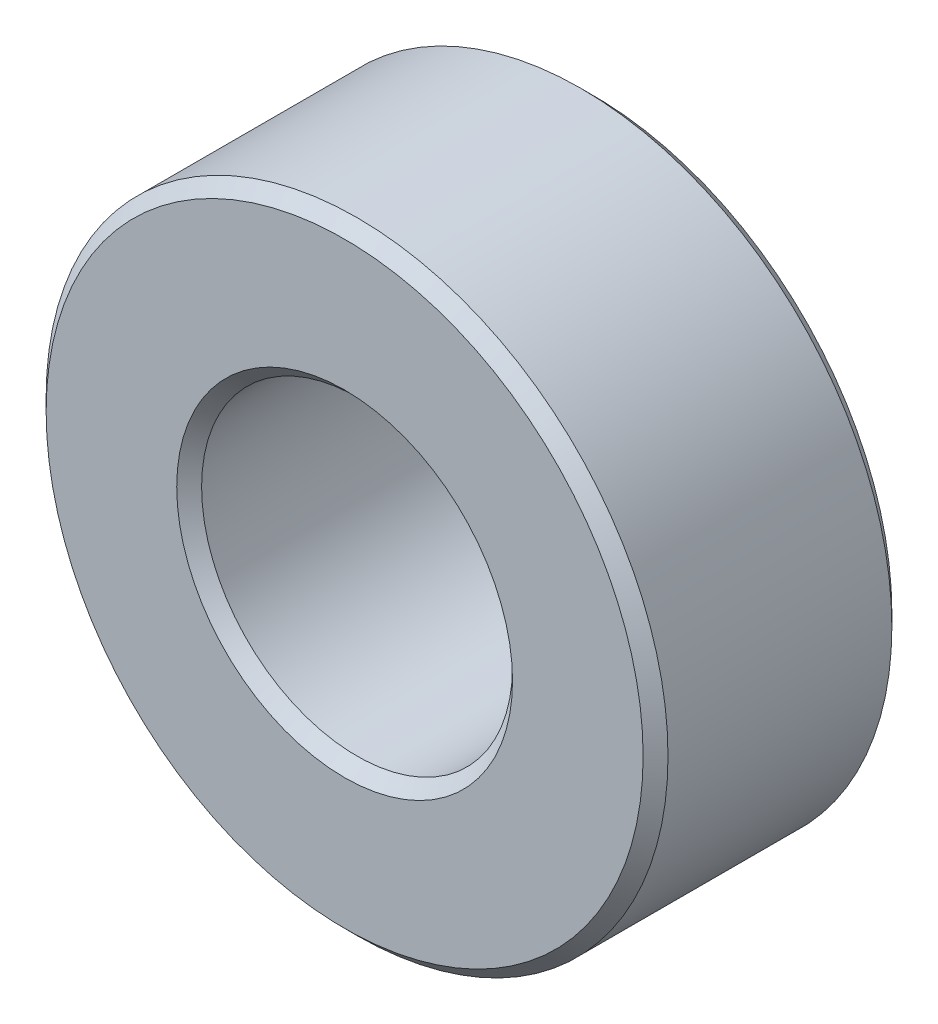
from build123d import *

# Parameters (mm, degrees)
SKETCH1_R           = 2.5
SKETCH1_R_2         = 1.25
BOSS_EXTRUDE2_DEPTH = 1
CHAMFER3_SIZE       = 0.1


with BuildPart() as part:
    # Sketch1 → Boss-Extrude2 (new, symmetric)
    with BuildSketch(Plane.XY):
        Circle(SKETCH1_R)
        Circle(SKETCH1_R_2, mode=Mode.SUBTRACT)
    extrude(amount=BOSS_EXTRUDE2_DEPTH, both=True)

    # Chamfer3
    chamfer3_edges = [part.edges().sort_by_distance(p)[0] for p in [
        (-2.5, 0, -1),
        (-2.5, 0, 1),
        (-1.25, 0, -1),
        (-1.25, 0, 1),
    ]]
    chamfer(chamfer3_edges, length=CHAMFER3_SIZE)


solid = part.part
